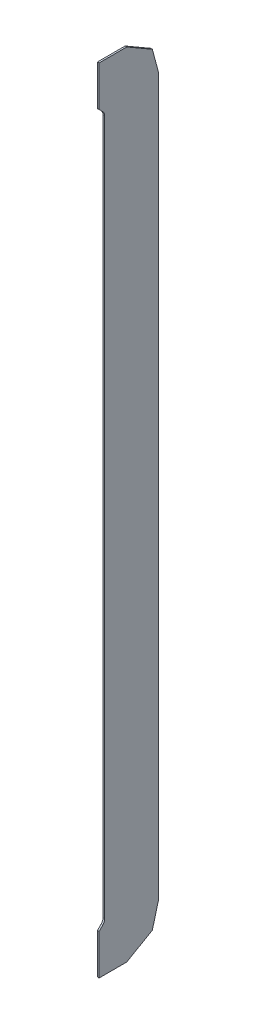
from build123d import *

# Parameters (mm, degrees)
SKETCH1_W               = 38.1
SKETCH1_H               = 1346.0125
BOSS_EXTRUDE1_DEPTH     = 8973.4125
CUT_EXTRUDE2_DEPTH      = 8999.635019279
CUT_EXTRUDE2_DEPTH_BACK = 8999.635019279
CUT_EXTRUDE3_DEPTH      = 8999.635019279
CUT_EXTRUDE3_DEPTH_BACK = 8999.635019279


with BuildPart() as part:
    # Sketch1 → Boss-Extrude1 (new, symmetric)
    with BuildSketch(Plane(origin=(0, 0, 0), x_dir=(-1, 0, 0), z_dir=(0, 1, 0))):
        Rectangle(SKETCH1_W, SKETCH1_H)
    extrude(amount=BOSS_EXTRUDE1_DEPTH, both=True)

    # Sketch3 → Cut-Extrude2 (cut, two sides: drawn at the far end of the back side and taken through both)
    with BuildSketch(Plane.YZ.offset(-CUT_EXTRUDE2_DEPTH_BACK)):
        Polygon((-9456.112090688, 659.75735), (-9456.112090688, -923.00625), (-8004.0147, -923.00625), (-8004.0147, -702.10241048), (-8638.886817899, -531.988939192), (-8973.4125, 47.426538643), (-8973.4125, 659.75735), align=None)
        Polygon((9456.112090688, -923.00625), (8004.0147, -923.00625), (8004.0147, -702.10241048), (8638.886817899, -531.988939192), (8973.4125, 47.426538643), (8973.4125, 659.75735), (9456.112090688, 659.75735), align=None)
    extrude(amount=CUT_EXTRUDE2_DEPTH + CUT_EXTRUDE2_DEPTH_BACK, mode=Mode.SUBTRACT)

    # Sketch4 → Cut-Extrude3 (cut, two sides: drawn at the far end of the back side and taken through both)
    with BuildSketch(Plane.YZ.offset(-CUT_EXTRUDE3_DEPTH_BACK)):
        with BuildLine():
            Line((-7867.996897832, 546.19375), (7867.996897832, 546.19375))
            ThreePointArc((7867.996897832, 546.19375), (7927.312829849, 557.992422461), (7977.598448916, 591.592198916))
            Line((7977.598448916, 591.592198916), (8059.0125, 673.00625))
            Line((8059.0125, 673.00625), (-8059.0125, 673.00625))
            Line((-8059.0125, 673.00625), (-7977.598448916, 591.592198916))
            ThreePointArc((-7977.598448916, 591.592198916), (-7927.312829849, 557.992422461), (-7867.996897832, 546.19375))
        make_face()
    extrude(amount=CUT_EXTRUDE3_DEPTH + CUT_EXTRUDE3_DEPTH_BACK, mode=Mode.SUBTRACT)


solid = part.part
